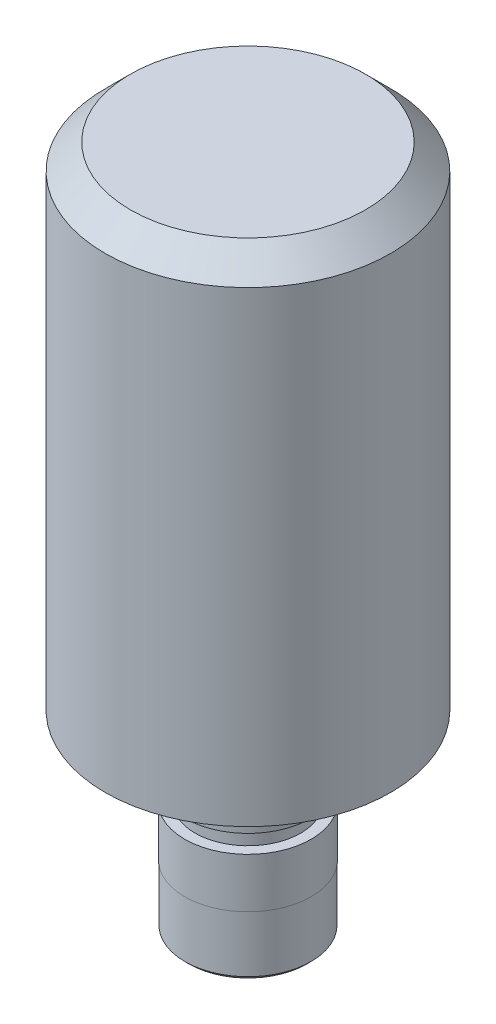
from build123d import *

# Parameters (mm, degrees)
SKETCH1_R          = 17.9959
EXTRUDE1_DEPTH     = 62.0268
CHAMFER1_SIZE      = 3.175
SKETCH2_R          = 7.9756
EXTRUDE2_DEPTH     = 16.383
SKETCH3_R          = 7.9375
EXTRUDE3_DEPTH     = 7.62
SKETCH4_R          = 6.0325
CUT_EXTRUDE1_DEPTH = 10.922
CHAMFER7_SIZE      = 0.508
SKETCH5_R          = 1.9939
CUT_EXTRUDE2_DEPTH = 1.27
SKETCH6_W          = 1.3208
SKETCH6_H          = 2.286


with BuildPart() as part:
    # Sketch1 → Extrude1 (new body)
    with BuildSketch(Plane(origin=(0, 0, 0), x_dir=(1, 0, 0), z_dir=(0, 1, 0))):
        with Locations(Location((0, 0, 0), (0, 0, 270))):
            Circle(SKETCH1_R)
    extrude(amount=-EXTRUDE1_DEPTH)

    # Chamfer1
    chamfer1_edges = [part.edges().sort_by_distance(p)[0] for p in [
        (0, 0, -17.9959),
    ]]
    chamfer(chamfer1_edges, length=CHAMFER1_SIZE)

    # Sketch2 → Extrude2 (add)
    with BuildSketch(Plane.XZ.offset(62.0268)):
        with Locations(Location((0, 0, 0), (0, 0, 90))):
            Circle(SKETCH2_R)
    extrude(amount=EXTRUDE2_DEPTH)

    # Sketch3 → Extrude3 (add)
    with BuildSketch(Plane.XZ.offset(78.4098)):
        with Locations(Location((0, 0, 0), (0, 0, 90))):
            Circle(SKETCH3_R)
    extrude(amount=EXTRUDE3_DEPTH)

    # Sketch4 → Cut-Extrude1 (cut)
    with BuildSketch(Plane.XZ.offset(86.0298)):
        with Locations(Location((0, 0, 0), (0, 0, 270))):
            Circle(SKETCH4_R)
    extrude(amount=-CUT_EXTRUDE1_DEPTH, mode=Mode.SUBTRACT)

    # Chamfer7
    chamfer7_edges = [part.edges().sort_by_distance(p)[0] for p in [
        (0, -86.0298, -7.9375),
        (0, -86.0298, 6.0325),
    ]]
    chamfer(chamfer7_edges, length=CHAMFER7_SIZE)

    # Sketch5 → Cut-Extrude2 (cut)
    with BuildSketch(Plane.XZ.offset(62.0268)):
        with Locations(Location((0, 11.049, 0), (0, 0, 270))):
            Circle(SKETCH5_R)
    extrude(amount=-CUT_EXTRUDE2_DEPTH, mode=Mode.SUBTRACT)

    # Sketch6 → Cut-Revolve1 (revolve, cut)
    with BuildSketch(Plane(origin=(0, 0, 0), x_dir=(0, 0, -1), z_dir=(1, 0, 0))):
        with Locations((-7.3152, -66.9798)):
            Rectangle(SKETCH6_W, SKETCH6_H)
        with Locations((-7.3152, -70.993)):
            Rectangle(SKETCH6_W, SKETCH6_H)
    revolve(axis=Axis((0, 2.406328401, 0), (0, -1, 0)), mode=Mode.SUBTRACT)


solid = part.part
